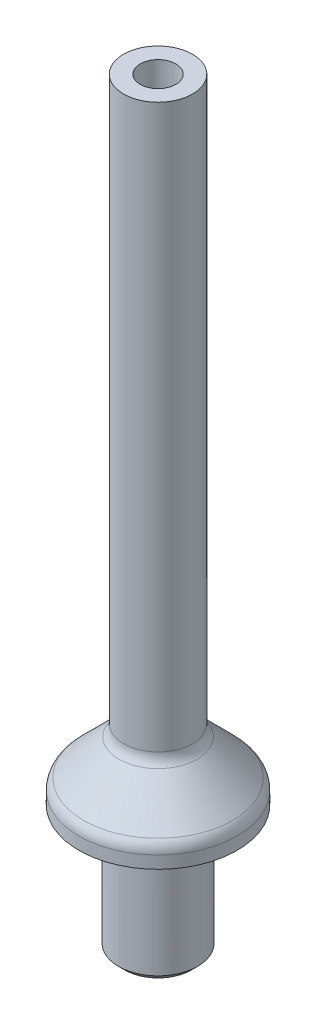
from build123d import *

# Parameters (mm, degrees)
FILLET2_R     = 0.127
FILLET3_R     = 3.175
CHAMFER1_SIZE = 1.27


with BuildPart() as part:
    # Sketch1 → Revolve1 (revolve)
    with BuildSketch(Plane.XY, mode=Mode.PRIVATE) as revolve1_sk:
        Polygon((-7.9375, -25.4), (-7.9375, -1.905), (-6.9215, -1.905), (-6.9215, 0), (-15.875, 0), (-15.875, 3.81), (-6.9215, 12.7635), (-6.9215, 127), (-3.571875, 127), (-3.571875, -7.62), (-4.8895, -7.62), (-4.8895, -25.4), align=None)
    revolve(revolve1_sk.sketch.rotate(Axis((0, 0, 0), (0, 1, 0)), 270), axis=Axis((0, 0, 0), (0, 1, 0)))

    # Groove Sketch → O-Ring Groove (revolve, cut)
    with BuildSketch(Plane(origin=(0, 0, 0), x_dir=(0, -1, 0), z_dir=(0, 0, 1))):
        with BuildLine():
            Line((-2.1971, -8.5217), (0, -8.5217))
            Line((0, -8.5217), (0, -13.1445))
            Line((0, -13.1445), (-2.1971, -13.1445))
            ThreePointArc((-2.1971, -13.1445), (-2.511408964, -13.014308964), (-2.6416, -12.7))
            Line((-2.6416, -12.7), (-2.6416, -8.9662))
            ThreePointArc((-2.6416, -8.9662), (-2.511408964, -8.651891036), (-2.1971, -8.5217))
        make_face()
    revolve(axis=Axis((0, 0, 0), (0, 1, 0)), mode=Mode.SUBTRACT)

    # Fillet2
    fillet2_edges = [part.edges().sort_by_distance(p)[0] for p in [
        (8.5217, 0, 0),
        (13.1445, 0, 0),
    ]]
    fillet(fillet2_edges, radius=FILLET2_R)

    # Fillet3
    fillet3_edges = [part.edges().sort_by_distance(p)[0] for p in [
        (0, 12.7635, 6.9215),
        (0, 3.81, 15.875),
    ]]
    fillet(fillet3_edges, radius=FILLET3_R)

    # Chamfer1
    chamfer1_edges = [part.edges().sort_by_distance(p)[0] for p in [
        (0, -25.4, 7.9375),
    ]]
    chamfer(chamfer1_edges, length=CHAMFER1_SIZE)


solid = part.part
